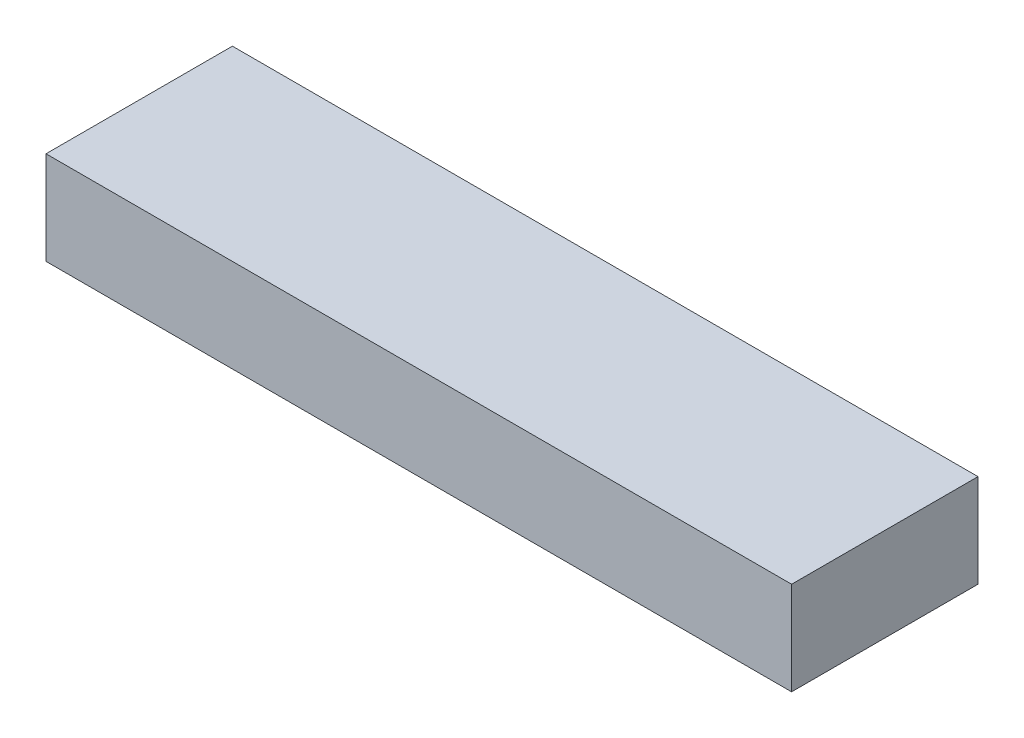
ISO-10303-21;
HEADER;
FILE_DESCRIPTION(('STEP AP214'),'2;1');
FILE_NAME('part.step','',(''),(''),'','','');
FILE_SCHEMA(('AUTOMOTIVE_DESIGN { 1 0 10303 214 1 1 1 1 }'));
ENDSEC;
DATA;
#1=APPLICATION_CONTEXT('core data for automotive mechanical design processes');
#2=APPLICATION_PROTOCOL_DEFINITION('international standard','automotive_design',2000,#1);
#3=PRODUCT_CONTEXT('',#1,'mechanical');
#4=PRODUCT('Part','Part','',(#3));
#5=PRODUCT_RELATED_PRODUCT_CATEGORY('part','',(#4));
#6=PRODUCT_DEFINITION_FORMATION('','',#4);
#7=PRODUCT_DEFINITION_CONTEXT('part definition',#1,'design');
#8=PRODUCT_DEFINITION('design','',#6,#7);
#9=PRODUCT_DEFINITION_SHAPE('','',#8);
#10=(LENGTH_UNIT() NAMED_UNIT(*) SI_UNIT(.MILLI.,.METRE.));
#11=(NAMED_UNIT(*) PLANE_ANGLE_UNIT() SI_UNIT($,.RADIAN.));
#12=(NAMED_UNIT(*) SI_UNIT($,.STERADIAN.) SOLID_ANGLE_UNIT());
#13=UNCERTAINTY_MEASURE_WITH_UNIT(LENGTH_MEASURE(1.E-05),#10,'distance_accuracy_value','');
#14=(GEOMETRIC_REPRESENTATION_CONTEXT(3) GLOBAL_UNCERTAINTY_ASSIGNED_CONTEXT((#13)) GLOBAL_UNIT_ASSIGNED_CONTEXT((#10,
#11,#12)) REPRESENTATION_CONTEXT('',''));
#15=CARTESIAN_POINT('',(0.,0.,0.));
#16=DIRECTION('',(0.,0.,1.));
#17=DIRECTION('',(1.,0.,0.));
#18=AXIS2_PLACEMENT_3D('',#15,#16,#17);
#19=CARTESIAN_POINT('',(120.,0.,0.));
#20=DIRECTION('',(0.,0.,-1.));
#21=DIRECTION('',(-1.,0.,0.));
#22=AXIS2_PLACEMENT_3D('',#19,#20,#21);
#23=PLANE('',#22);
#24=DIRECTION('',(0.,-1.,0.));
#25=VECTOR('',#24,1.);
#26=CARTESIAN_POINT('',(0.,0.,0.));
#27=LINE('',#26,#25);
#28=CARTESIAN_POINT('',(0.,15.,0.));
#29=VERTEX_POINT('',#28);
#30=CARTESIAN_POINT('',(0.,0.,0.));
#31=VERTEX_POINT('',#30);
#32=EDGE_CURVE('E105',#29,#31,#27,.T.);
#33=ORIENTED_EDGE('',*,*,#32,.T.);
#34=DIRECTION('',(-1.,0.,0.));
#35=VECTOR('',#34,1.);
#36=CARTESIAN_POINT('',(120.,0.,0.));
#37=LINE('',#36,#35);
#38=CARTESIAN_POINT('',(120.,0.,0.));
#39=VERTEX_POINT('',#38);
#40=EDGE_CURVE('E12',#39,#31,#37,.T.);
#41=ORIENTED_EDGE('',*,*,#40,.F.);
#42=DIRECTION('',(0.,-1.,0.));
#43=VECTOR('',#42,1.);
#44=CARTESIAN_POINT('',(120.,0.,0.));
#45=LINE('',#44,#43);
#46=CARTESIAN_POINT('',(120.,15.,0.));
#47=VERTEX_POINT('',#46);
#48=EDGE_CURVE('E94',#47,#39,#45,.T.);
#49=ORIENTED_EDGE('',*,*,#48,.F.);
#50=DIRECTION('',(-1.,0.,0.));
#51=VECTOR('',#50,1.);
#52=CARTESIAN_POINT('',(120.,15.,0.));
#53=LINE('',#52,#51);
#54=EDGE_CURVE('E102',#47,#29,#53,.T.);
#55=ORIENTED_EDGE('',*,*,#54,.T.);
#56=EDGE_LOOP('',(#33,#41,#49,#55));
#57=FACE_BOUND('',#56,.T.);
#58=ADVANCED_FACE('F43',(#57),#23,.F.);
#59=CARTESIAN_POINT('',(120.,0.,0.));
#60=DIRECTION('',(0.,1.,0.));
#61=DIRECTION('',(0.,0.,1.));
#62=AXIS2_PLACEMENT_3D('',#59,#60,#61);
#63=PLANE('',#62);
#64=DIRECTION('',(0.,0.,-1.));
#65=VECTOR('',#64,1.);
#66=CARTESIAN_POINT('',(0.,0.,0.));
#67=LINE('',#66,#65);
#68=CARTESIAN_POINT('',(0.,0.,-30.));
#69=VERTEX_POINT('',#68);
#70=EDGE_CURVE('E98',#31,#69,#67,.T.);
#71=ORIENTED_EDGE('',*,*,#70,.T.);
#72=DIRECTION('',(-1.,0.,0.));
#73=VECTOR('',#72,1.);
#74=CARTESIAN_POINT('',(120.,0.,-30.));
#75=LINE('',#74,#73);
#76=CARTESIAN_POINT('',(120.,0.,-30.));
#77=VERTEX_POINT('',#76);
#78=EDGE_CURVE('E51',#77,#69,#75,.T.);
#79=ORIENTED_EDGE('',*,*,#78,.F.);
#80=DIRECTION('',(0.,0.,-1.));
#81=VECTOR('',#80,1.);
#82=CARTESIAN_POINT('',(120.,0.,0.));
#83=LINE('',#82,#81);
#84=EDGE_CURVE('E89',#39,#77,#83,.T.);
#85=ORIENTED_EDGE('',*,*,#84,.F.);
#86=ORIENTED_EDGE('',*,*,#40,.T.);
#87=EDGE_LOOP('',(#71,#79,#85,#86));
#88=FACE_BOUND('',#87,.T.);
#89=ADVANCED_FACE('F97',(#88),#63,.F.);
#90=CARTESIAN_POINT('',(120.,0.,-30.));
#91=DIRECTION('',(0.,0.,1.));
#92=DIRECTION('',(1.,0.,0.));
#93=AXIS2_PLACEMENT_3D('',#90,#91,#92);
#94=PLANE('',#93);
#95=DIRECTION('',(0.,1.,0.));
#96=VECTOR('',#95,1.);
#97=CARTESIAN_POINT('',(0.,0.,-30.));
#98=LINE('',#97,#96);
#99=CARTESIAN_POINT('',(0.,15.,-30.));
#100=VERTEX_POINT('',#99);
#101=EDGE_CURVE('E76',#69,#100,#98,.T.);
#102=ORIENTED_EDGE('',*,*,#101,.T.);
#103=DIRECTION('',(-1.,0.,0.));
#104=VECTOR('',#103,1.);
#105=CARTESIAN_POINT('',(120.,15.,-30.));
#106=LINE('',#105,#104);
#107=CARTESIAN_POINT('',(120.,15.,-30.));
#108=VERTEX_POINT('',#107);
#109=EDGE_CURVE('E99',#108,#100,#106,.T.);
#110=ORIENTED_EDGE('',*,*,#109,.F.);
#111=DIRECTION('',(0.,1.,0.));
#112=VECTOR('',#111,1.);
#113=CARTESIAN_POINT('',(120.,0.,-30.));
#114=LINE('',#113,#112);
#115=EDGE_CURVE('E92',#77,#108,#114,.T.);
#116=ORIENTED_EDGE('',*,*,#115,.F.);
#117=ORIENTED_EDGE('',*,*,#78,.T.);
#118=EDGE_LOOP('',(#102,#110,#116,#117));
#119=FACE_BOUND('',#118,.T.);
#120=ADVANCED_FACE('F100',(#119),#94,.F.);
#121=CARTESIAN_POINT('',(120.,15.,0.));
#122=DIRECTION('',(0.,-1.,0.));
#123=DIRECTION('',(0.,0.,-1.));
#124=AXIS2_PLACEMENT_3D('',#121,#122,#123);
#125=PLANE('',#124);
#126=DIRECTION('',(0.,0.,1.));
#127=VECTOR('',#126,1.);
#128=CARTESIAN_POINT('',(0.,15.,0.));
#129=LINE('',#128,#127);
#130=EDGE_CURVE('E82',#100,#29,#129,.T.);
#131=ORIENTED_EDGE('',*,*,#130,.T.);
#132=ORIENTED_EDGE('',*,*,#54,.F.);
#133=DIRECTION('',(0.,0.,1.));
#134=VECTOR('',#133,1.);
#135=CARTESIAN_POINT('',(120.,15.,0.));
#136=LINE('',#135,#134);
#137=EDGE_CURVE('E59',#108,#47,#136,.T.);
#138=ORIENTED_EDGE('',*,*,#137,.F.);
#139=ORIENTED_EDGE('',*,*,#109,.T.);
#140=EDGE_LOOP('',(#131,#132,#138,#139));
#141=FACE_BOUND('',#140,.T.);
#142=ADVANCED_FACE('F112',(#141),#125,.F.);
#143=CARTESIAN_POINT('',(120.,15.,0.));
#144=DIRECTION('',(-1.,0.,0.));
#145=DIRECTION('',(0.,0.,1.));
#146=AXIS2_PLACEMENT_3D('',#143,#144,#145);
#147=PLANE('',#146);
#148=ORIENTED_EDGE('',*,*,#48,.T.);
#149=ORIENTED_EDGE('',*,*,#84,.T.);
#150=ORIENTED_EDGE('',*,*,#115,.T.);
#151=ORIENTED_EDGE('',*,*,#137,.T.);
#152=EDGE_LOOP('',(#148,#149,#150,#151));
#153=FACE_BOUND('',#152,.T.);
#154=ADVANCED_FACE('F90',(#153),#147,.F.);
#155=CARTESIAN_POINT('',(0.,15.,0.));
#156=DIRECTION('',(-1.,0.,0.));
#157=DIRECTION('',(0.,0.,1.));
#158=AXIS2_PLACEMENT_3D('',#155,#156,#157);
#159=PLANE('',#158);
#160=ORIENTED_EDGE('',*,*,#32,.F.);
#161=ORIENTED_EDGE('',*,*,#130,.F.);
#162=ORIENTED_EDGE('',*,*,#101,.F.);
#163=ORIENTED_EDGE('',*,*,#70,.F.);
#164=EDGE_LOOP('',(#160,#161,#162,#163));
#165=FACE_BOUND('',#164,.T.);
#166=ADVANCED_FACE('F115',(#165),#159,.T.);
#167=CLOSED_SHELL('',(#58,#89,#120,#142,#154,#166));
#168=MANIFOLD_SOLID_BREP('B2',#167);
#169=ADVANCED_BREP_SHAPE_REPRESENTATION('',(#18,#168),#14);
#170=SHAPE_DEFINITION_REPRESENTATION(#9,#169);
ENDSEC;
END-ISO-10303-21;
